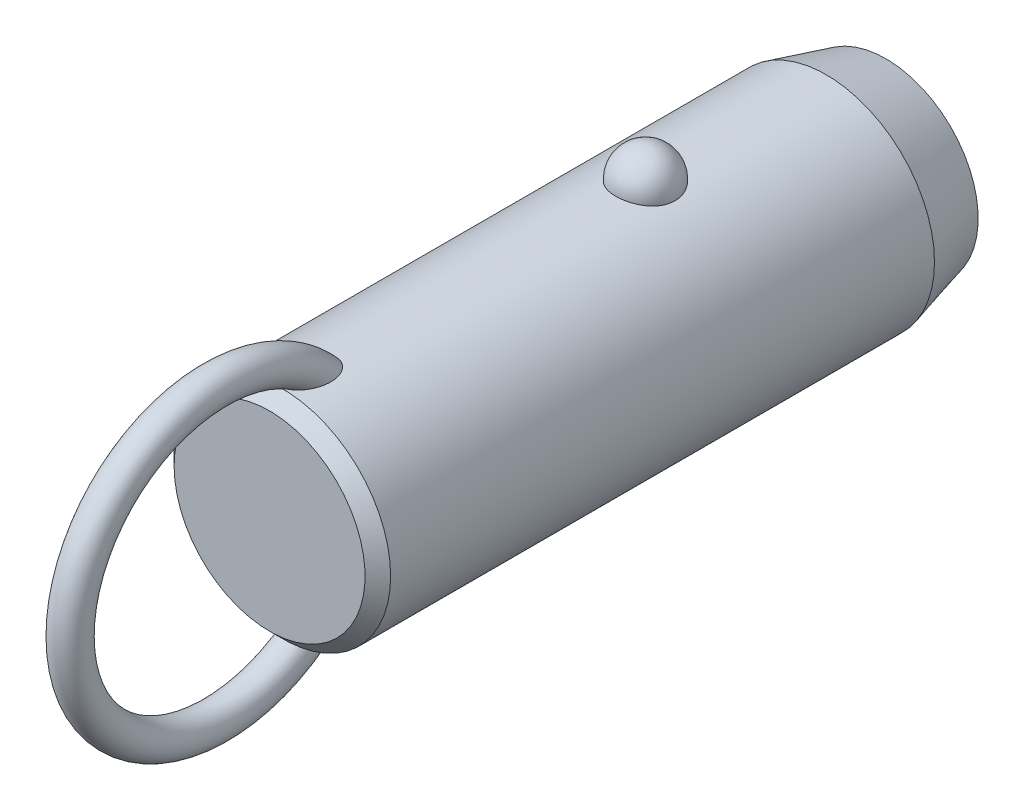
ISO-10303-21;
HEADER;
FILE_DESCRIPTION(('STEP AP214'),'2;1');
FILE_NAME('part.step','',(''),(''),'','','');
FILE_SCHEMA(('AUTOMOTIVE_DESIGN { 1 0 10303 214 1 1 1 1 }'));
ENDSEC;
DATA;
#1=APPLICATION_CONTEXT('core data for automotive mechanical design processes');
#2=APPLICATION_PROTOCOL_DEFINITION('international standard','automotive_design',2000,#1);
#3=PRODUCT_CONTEXT('',#1,'mechanical');
#4=PRODUCT('Part','Part','',(#3));
#5=PRODUCT_RELATED_PRODUCT_CATEGORY('part','',(#4));
#6=PRODUCT_DEFINITION_FORMATION('','',#4);
#7=PRODUCT_DEFINITION_CONTEXT('part definition',#1,'design');
#8=PRODUCT_DEFINITION('design','',#6,#7);
#9=PRODUCT_DEFINITION_SHAPE('','',#8);
#10=(LENGTH_UNIT() NAMED_UNIT(*) SI_UNIT(.MILLI.,.METRE.));
#11=(NAMED_UNIT(*) PLANE_ANGLE_UNIT() SI_UNIT($,.RADIAN.));
#12=(NAMED_UNIT(*) SI_UNIT($,.STERADIAN.) SOLID_ANGLE_UNIT());
#13=UNCERTAINTY_MEASURE_WITH_UNIT(LENGTH_MEASURE(1.E-05),#10,'distance_accuracy_value','');
#14=(GEOMETRIC_REPRESENTATION_CONTEXT(3) GLOBAL_UNCERTAINTY_ASSIGNED_CONTEXT((#13)) GLOBAL_UNIT_ASSIGNED_CONTEXT((#10,
#11,#12)) REPRESENTATION_CONTEXT('',''));
#15=CARTESIAN_POINT('',(0.,0.,0.));
#16=DIRECTION('',(0.,0.,1.));
#17=DIRECTION('',(1.,0.,0.));
#18=AXIS2_PLACEMENT_3D('',#15,#16,#17);
#19=CARTESIAN_POINT('',(0.,0.,27.9));
#20=DIRECTION('',(0.,0.,-1.));
#21=DIRECTION('',(-1.,0.,0.));
#22=AXIS2_PLACEMENT_3D('',#19,#20,#21);
#23=CYLINDRICAL_SURFACE('',#22,12.7);
#24=CARTESIAN_POINT('',(3.46661256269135,12.2177165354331,-3.5));
#25=CARTESIAN_POINT('',(3.4666090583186,12.2177194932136,-3.30432790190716));
#26=CARTESIAN_POINT('',(3.45063567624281,12.2222841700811,-3.10861112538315));
#27=CARTESIAN_POINT('',(3.38712451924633,12.2400345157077,-2.72271899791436));
#28=CARTESIAN_POINT('',(3.33957415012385,12.2532236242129,-2.53254588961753));
#29=CARTESIAN_POINT('',(3.2141234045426,12.286724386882,-2.16324948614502));
#30=CARTESIAN_POINT('',(3.13623639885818,12.3070329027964,-1.98412136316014));
#31=CARTESIAN_POINT('',(2.95205930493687,12.3525018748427,-1.64180592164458));
#32=CARTESIAN_POINT('',(2.84577003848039,12.3776621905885,-1.47861814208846));
#33=CARTESIAN_POINT('',(2.60688050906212,12.4301712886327,-1.17190583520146));
#34=CARTESIAN_POINT('',(2.47415697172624,12.4575299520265,-1.02847897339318));
#35=CARTESIAN_POINT('',(2.18615174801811,12.5112810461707,-0.766177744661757));
#36=CARTESIAN_POINT('',(2.03087002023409,12.5376734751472,-0.647303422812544));
#37=CARTESIAN_POINT('',(1.70237334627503,12.5864761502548,-0.437732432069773));
#38=CARTESIAN_POINT('',(1.52920948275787,12.6088972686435,-0.34695830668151));
#39=CARTESIAN_POINT('',(1.16944170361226,12.6473352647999,-0.195750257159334));
#40=CARTESIAN_POINT('',(0.982839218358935,12.663352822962,-0.135313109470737));
#41=CARTESIAN_POINT('',(0.604961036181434,12.6869706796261,-0.0473241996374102));
#42=CARTESIAN_POINT('',(0.413823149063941,12.6947125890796,-0.0192185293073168));
#43=CARTESIAN_POINT('',(0.0293827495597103,12.7014203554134,0.00517254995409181));
#44=CARTESIAN_POINT('',(-0.163919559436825,12.7003870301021,0.00146092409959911));
#45=CARTESIAN_POINT('',(-0.544374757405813,12.689735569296,-0.0373939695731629));
#46=CARTESIAN_POINT('',(-0.731575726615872,12.6802364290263,-0.0721015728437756));
#47=CARTESIAN_POINT('',(-1.09733277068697,12.6538333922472,-0.171364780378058));
#48=CARTESIAN_POINT('',(-1.27588869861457,12.6369293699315,-0.23592089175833));
#49=CARTESIAN_POINT('',(-1.6204698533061,12.5973946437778,-0.393548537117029));
#50=CARTESIAN_POINT('',(-1.78641865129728,12.5747321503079,-0.48677898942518));
#51=CARTESIAN_POINT('',(-2.10030671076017,12.5261316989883,-0.699110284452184));
#52=CARTESIAN_POINT('',(-2.24824419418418,12.5001934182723,-0.818213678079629));
#53=CARTESIAN_POINT('',(-2.52491489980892,12.4472906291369,-1.08157124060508));
#54=CARTESIAN_POINT('',(-2.65324222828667,12.4203160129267,-1.22624992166));
#55=CARTESIAN_POINT('',(-2.88410007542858,12.3687509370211,-1.53528325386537));
#56=CARTESIAN_POINT('',(-2.98662883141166,12.3441606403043,-1.69963924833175));
#57=CARTESIAN_POINT('',(-3.16432417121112,12.2998199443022,-2.04548497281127));
#58=CARTESIAN_POINT('',(-3.23917525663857,12.2801261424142,-2.22714424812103));
#59=CARTESIAN_POINT('',(-3.35800573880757,12.248167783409,-2.6009138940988));
#60=CARTESIAN_POINT('',(-3.4019860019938,12.2359030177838,-2.79302397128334));
#61=CARTESIAN_POINT('',(-3.45784812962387,12.2202347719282,-3.18140279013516));
#62=CARTESIAN_POINT('',(-3.46986123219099,12.2167950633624,-3.37765118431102));
#63=CARTESIAN_POINT('',(-3.46186273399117,12.2190638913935,-3.76943689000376));
#64=CARTESIAN_POINT('',(-3.44185196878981,12.2247721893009,-3.96497421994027));
#65=CARTESIAN_POINT('',(-3.37048652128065,12.2446381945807,-4.34881728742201));
#66=CARTESIAN_POINT('',(-3.31928253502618,12.2587552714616,-4.53715319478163));
#67=CARTESIAN_POINT('',(-3.18693461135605,12.2938237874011,-4.90231727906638));
#68=CARTESIAN_POINT('',(-3.1057895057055,12.3147754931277,-5.07914500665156));
#69=CARTESIAN_POINT('',(-2.91506431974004,12.3613125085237,-5.4173205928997));
#70=CARTESIAN_POINT('',(-2.80533587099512,12.3869217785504,-5.57858147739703));
#71=CARTESIAN_POINT('',(-2.560414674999,12.4398525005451,-5.88013283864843));
#72=CARTESIAN_POINT('',(-2.42522099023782,12.4671740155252,-6.02042254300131));
#73=CARTESIAN_POINT('',(-2.1323357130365,12.5205965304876,-6.27662798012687));
#74=CARTESIAN_POINT('',(-1.97456596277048,12.5466928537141,-6.39245542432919));
#75=CARTESIAN_POINT('',(-1.64115839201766,12.5946384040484,-6.59583547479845));
#76=CARTESIAN_POINT('',(-1.46552179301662,12.6164879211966,-6.68339001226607));
#77=CARTESIAN_POINT('',(-1.10356050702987,12.6532533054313,-6.82682153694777));
#78=CARTESIAN_POINT('',(-0.917391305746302,12.6682500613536,-6.88306988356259));
#79=CARTESIAN_POINT('',(-0.537836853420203,12.6900288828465,-6.96386887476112));
#80=CARTESIAN_POINT('',(-0.344452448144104,12.6968119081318,-6.9884232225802));
#81=CARTESIAN_POINT('',(0.0402577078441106,12.7013667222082,-7.00496469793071));
#82=CARTESIAN_POINT('',(0.231556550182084,12.6993008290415,-6.99753844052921));
#83=CARTESIAN_POINT('',(0.610105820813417,12.6867505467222,-6.95166366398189));
#84=CARTESIAN_POINT('',(0.797356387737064,12.6762664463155,-6.91321620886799));
#85=CARTESIAN_POINT('',(1.16186657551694,12.6480587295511,-6.80658431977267));
#86=CARTESIAN_POINT('',(1.33915951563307,12.6303611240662,-6.73850666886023));
#87=CARTESIAN_POINT('',(1.67968518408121,12.5896027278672,-6.57450875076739));
#88=CARTESIAN_POINT('',(1.84291705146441,12.5665416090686,-6.47858678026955));
#89=CARTESIAN_POINT('',(2.15340192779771,12.5171072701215,-6.25982455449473));
#90=CARTESIAN_POINT('',(2.30037831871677,12.4906895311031,-6.13660186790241));
#91=CARTESIAN_POINT('',(2.5717412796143,12.4376567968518,-5.86739587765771));
#92=CARTESIAN_POINT('',(2.69612388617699,12.4110417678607,-5.72140858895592));
#93=CARTESIAN_POINT('',(2.92107785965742,12.360051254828,-5.40794137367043));
#94=CARTESIAN_POINT('',(3.02121329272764,12.3357209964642,-5.24014110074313));
#95=CARTESIAN_POINT('',(3.19236291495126,12.2925446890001,-4.8896986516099));
#96=CARTESIAN_POINT('',(3.26338839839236,12.2736965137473,-4.70706226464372));
#97=CARTESIAN_POINT('',(3.36788038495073,12.245404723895,-4.35469510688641));
#98=CARTESIAN_POINT('',(3.40484026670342,12.2351018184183,-4.18605935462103));
#99=CARTESIAN_POINT('',(3.45420764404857,12.2212564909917,-3.84496058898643));
#100=CARTESIAN_POINT('',(3.46661565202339,12.2177139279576,-3.67249765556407));
#101=CARTESIAN_POINT('',(3.46661256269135,12.2177165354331,-3.5));
#102=B_SPLINE_CURVE_WITH_KNOTS('',3,(#24,#25,#26,#27,#28,#29,#30,#31,#32,#33,#34,#35,#36,#37,
#38,#39,#40,#41,#42,#43,#44,#45,#46,#47,#48,#49,#50,#51,#52,#53,#54,#55,#56,#57,#58,#59,#60,#61,
#62,#63,#64,#65,#66,#67,#68,#69,#70,#71,#72,#73,#74,#75,#76,#77,#78,#79,#80,#81,#82,#83,#84,#85,
#86,#87,#88,#89,#90,#91,#92,#93,#94,#95,#96,#97,#98,#99,#100,#101),.UNSPECIFIED.,.T.,.F.,(4,2,2,
2,2,2,2,2,2,2,2,2,2,2,2,2,2,2,2,2,2,2,2,2,2,2,2,2,2,2,2,2,2,2,2,2,2,2,4),(0.,0.586396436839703,
1.17302689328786,1.7593990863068,2.34575431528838,2.93491084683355,3.52406845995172,
4.1115873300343,4.69904375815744,5.2762784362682,5.85345931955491,6.42265312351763,
6.99185659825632,7.56427334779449,8.136746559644,8.71981013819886,9.3029135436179,
9.89247258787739,10.4820150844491,11.0691335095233,11.6562366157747,12.2405256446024,
12.8248374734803,13.412244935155,13.9996740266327,14.5891883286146,15.1786623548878,
15.7609861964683,16.3432419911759,16.914863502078,17.4864654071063,18.056024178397,
18.6256177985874,19.2037609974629,19.7820055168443,20.3699810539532,20.9577282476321,
21.4746855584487,21.9916320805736),.UNSPECIFIED.);
#103=CARTESIAN_POINT('',(3.46661256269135,12.2177165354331,-3.5));
#104=VERTEX_POINT('',#103);
#105=EDGE_CURVE('E41',#104,#104,#102,.T.);
#106=ORIENTED_EDGE('',*,*,#105,.T.);
#107=EDGE_LOOP('',(#106));
#108=FACE_BOUND('',#107,.T.);
#109=CARTESIAN_POINT('',(0.,0.,39.1));
#110=DIRECTION('',(0.,0.,1.));
#111=DIRECTION('',(1.,0.,0.));
#112=AXIS2_PLACEMENT_3D('',#109,#110,#111);
#113=CIRCLE('',#112,12.7);
#114=CARTESIAN_POINT('',(-12.7,0.,39.1));
#115=VERTEX_POINT('',#114);
#116=EDGE_CURVE('E10',#115,#115,#113,.F.);
#117=ORIENTED_EDGE('',*,*,#116,.T.);
#118=EDGE_LOOP('',(#117));
#119=FACE_BOUND('',#118,.T.);
#120=CARTESIAN_POINT('',(-0.548122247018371,-12.6881662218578,32.8432187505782));
#121=CARTESIAN_POINT('',(-0.648865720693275,-12.6838128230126,32.877926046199));
#122=CARTESIAN_POINT('',(-0.746398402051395,-12.6783867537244,32.9220428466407));
#123=CARTESIAN_POINT('',(-0.932125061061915,-12.666091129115,33.0267647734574));
#124=CARTESIAN_POINT('',(-1.02030388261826,-12.6592192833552,33.087396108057));
#125=CARTESIAN_POINT('',(-1.18487740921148,-12.6448747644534,33.221847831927));
#126=CARTESIAN_POINT('',(-1.26134296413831,-12.637406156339,33.2955825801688));
#127=CARTESIAN_POINT('',(-1.4023120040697,-12.6225412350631,33.4536045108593));
#128=CARTESIAN_POINT('',(-1.46681470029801,-12.6151449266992,33.5378923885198));
#129=CARTESIAN_POINT('',(-1.60714786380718,-12.5981718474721,33.7496577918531));
#130=CARTESIAN_POINT('',(-1.67725126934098,-12.588900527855,33.8809624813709));
#131=CARTESIAN_POINT('',(-1.79536591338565,-12.5725964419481,34.1532471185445));
#132=CARTESIAN_POINT('',(-1.84333535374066,-12.5655679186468,34.2942447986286));
#133=CARTESIAN_POINT('',(-1.93422576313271,-12.5519624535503,34.6376455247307));
#134=CARTESIAN_POINT('',(-1.96788773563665,-12.5466298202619,34.8425578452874));
#135=CARTESIAN_POINT('',(-1.9941399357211,-12.542463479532,35.1517600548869));
#136=CARTESIAN_POINT('',(-1.99883864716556,-12.5417153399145,35.2552987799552));
#137=CARTESIAN_POINT('',(-2.00078003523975,-12.5414074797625,35.4624512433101));
#138=CARTESIAN_POINT('',(-1.99802449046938,-12.5418474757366,35.5660649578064));
#139=CARTESIAN_POINT('',(-1.98336733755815,-12.5441750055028,35.8103207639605));
#140=CARTESIAN_POINT('',(-1.96851430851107,-12.5465291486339,35.950780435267));
#141=CARTESIAN_POINT('',(-1.92707089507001,-12.5529612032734,36.229960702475));
#142=CARTESIAN_POINT('',(-1.900474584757,-12.5570399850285,36.3686803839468));
#143=CARTESIAN_POINT('',(-1.83619120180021,-12.5666008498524,36.6434113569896));
#144=CARTESIAN_POINT('',(-1.79850828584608,-12.57208240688,36.7794236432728));
#145=CARTESIAN_POINT('',(-1.71223796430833,-12.5841228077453,37.0478421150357));
#146=CARTESIAN_POINT('',(-1.66365679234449,-12.5906810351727,37.1802503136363));
#147=CARTESIAN_POINT('',(-1.57804503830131,-12.6016176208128,37.3854887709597));
#148=CARTESIAN_POINT('',(-1.54477252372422,-12.6057501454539,37.4599149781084));
#149=CARTESIAN_POINT('',(-1.47424480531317,-12.6141930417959,37.6068393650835));
#150=CARTESIAN_POINT('',(-1.43699041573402,-12.6185033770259,37.6793379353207));
#151=CARTESIAN_POINT('',(-1.35825795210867,-12.6272207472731,37.8218926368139));
#152=CARTESIAN_POINT('',(-1.31678520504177,-12.6316276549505,37.8919517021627));
#153=CARTESIAN_POINT('',(-1.22917793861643,-12.6404532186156,38.0290705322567));
#154=CARTESIAN_POINT('',(-1.18304514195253,-12.6448718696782,38.0961313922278));
#155=CARTESIAN_POINT('',(-1.0724641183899,-12.6547893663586,38.2438741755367));
#156=CARTESIAN_POINT('',(-1.00642239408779,-12.6602600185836,38.3233844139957));
#157=CARTESIAN_POINT('',(-0.864441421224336,-12.6707460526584,38.4731698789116));
#158=CARTESIAN_POINT('',(-0.78851691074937,-12.6757620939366,38.5434585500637));
#159=CARTESIAN_POINT('',(-0.652215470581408,-12.6833591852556,38.6486801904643));
#160=CARTESIAN_POINT('',(-0.594982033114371,-12.6861973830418,38.6876241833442));
#161=CARTESIAN_POINT('',(-0.475269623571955,-12.6912445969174,38.7564899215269));
#162=CARTESIAN_POINT('',(-0.412800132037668,-12.6934547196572,38.7864275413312));
#163=CARTESIAN_POINT('',(-0.295749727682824,-12.6966636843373,38.8297565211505));
#164=CARTESIAN_POINT('',(-0.241949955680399,-12.6978134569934,38.8452188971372));
#165=CARTESIAN_POINT('',(-0.13250810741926,-12.6994261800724,38.8668845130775));
#166=CARTESIAN_POINT('',(-0.0768679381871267,-12.6998898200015,38.8730970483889));
#167=CARTESIAN_POINT('',(0.0347696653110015,-12.7000752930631,38.8755838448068));
#168=CARTESIAN_POINT('',(0.0907676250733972,-12.6997954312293,38.8718353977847));
#169=CARTESIAN_POINT('',(0.201283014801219,-12.6985255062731,38.8547883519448));
#170=CARTESIAN_POINT('',(0.255799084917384,-12.6975348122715,38.8414812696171));
#171=CARTESIAN_POINT('',(0.376042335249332,-12.6946091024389,38.8020379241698));
#172=CARTESIAN_POINT('',(0.440950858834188,-12.6924943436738,38.7734492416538));
#173=CARTESIAN_POINT('',(0.565350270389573,-12.6875639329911,38.7063234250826));
#174=CARTESIAN_POINT('',(0.624828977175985,-12.6847467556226,38.6677646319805));
#175=CARTESIAN_POINT('',(0.774116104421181,-12.6767252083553,38.556949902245));
#176=CARTESIAN_POINT('',(0.859449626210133,-12.6711344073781,38.4787605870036));
#177=CARTESIAN_POINT('',(1.01789440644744,-12.6593922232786,38.310943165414));
#178=CARTESIAN_POINT('',(1.09096902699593,-12.653239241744,38.221282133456));
#179=CARTESIAN_POINT('',(1.22268793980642,-12.6411674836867,38.0402658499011));
#180=CARTESIAN_POINT('',(1.28193986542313,-12.6352572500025,37.949345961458));
#181=CARTESIAN_POINT('',(1.39259777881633,-12.6235401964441,37.7627929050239));
#182=CARTESIAN_POINT('',(1.44399707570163,-12.6177334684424,37.6671558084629));
#183=CARTESIAN_POINT('',(1.53972870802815,-12.6064093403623,37.4722738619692));
#184=CARTESIAN_POINT('',(1.58405262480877,-12.6008922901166,37.3730248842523));
#185=CARTESIAN_POINT('',(1.66600705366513,-12.5903187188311,37.1717727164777));
#186=CARTESIAN_POINT('',(1.7036365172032,-12.5852622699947,37.0697690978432));
#187=CARTESIAN_POINT('',(1.77545379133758,-12.5753406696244,36.8543580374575));
#188=CARTESIAN_POINT('',(1.80903453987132,-12.5705328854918,36.740745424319));
#189=CARTESIAN_POINT('',(1.86844163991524,-12.5618400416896,36.5114575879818));
#190=CARTESIAN_POINT('',(1.89426665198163,-12.5579551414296,36.3957820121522));
#191=CARTESIAN_POINT('',(1.9378546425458,-12.5513030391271,36.1630072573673));
#192=CARTESIAN_POINT('',(1.9556264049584,-12.5485346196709,36.0459097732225));
#193=CARTESIAN_POINT('',(1.98264463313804,-12.5442934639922,35.8107473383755));
#194=CARTESIAN_POINT('',(1.99189298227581,-12.5428204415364,35.6926826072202));
#195=CARTESIAN_POINT('',(2.00416068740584,-12.540871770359,35.3806225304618));
#196=CARTESIAN_POINT('',(1.99944433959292,-12.541631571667,35.1862290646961));
#197=CARTESIAN_POINT('',(1.96113755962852,-12.5476846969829,34.8003095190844));
#198=CARTESIAN_POINT('',(1.92758341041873,-12.5529723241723,34.6087801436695));
#199=CARTESIAN_POINT('',(1.8393434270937,-12.5661532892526,34.2822728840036));
#200=CARTESIAN_POINT('',(1.79215440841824,-12.5730485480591,34.1452499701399));
#201=CARTESIAN_POINT('',(1.67676242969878,-12.588958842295,33.8804459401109));
#202=CARTESIAN_POINT('',(1.60859050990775,-12.597970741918,33.7526515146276));
#203=CARTESIAN_POINT('',(1.46583832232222,-12.6152829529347,33.5358006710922));
#204=CARTESIAN_POINT('',(1.39525727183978,-12.6233659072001,33.4441050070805));
#205=CARTESIAN_POINT('',(1.23992594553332,-12.6395676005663,33.2734854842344));
#206=CARTESIAN_POINT('',(1.15517932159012,-12.6476863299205,33.1945583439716));
#207=CARTESIAN_POINT('',(0.971995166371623,-12.6630846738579,33.0526438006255));
#208=CARTESIAN_POINT('',(0.873456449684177,-12.6703572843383,32.9897849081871));
#209=CARTESIAN_POINT('',(0.665847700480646,-12.6829569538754,32.8844870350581));
#210=CARTESIAN_POINT('',(0.556784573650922,-12.688285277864,32.8420347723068));
#211=CARTESIAN_POINT('',(0.347338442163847,-12.6956226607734,32.7844434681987));
#212=CARTESIAN_POINT('',(0.247759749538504,-12.6979816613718,32.7663996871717));
#213=CARTESIAN_POINT('',(0.0470218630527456,-12.7003077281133,32.748600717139));
#214=CARTESIAN_POINT('',(-0.0541350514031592,-12.7002779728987,32.7488212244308));
#215=CARTESIAN_POINT('',(-0.221414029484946,-12.6982482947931,32.7643639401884));
#216=CARTESIAN_POINT('',(-0.288055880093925,-12.6969033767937,32.7746662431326));
#217=CARTESIAN_POINT('',(-0.41959929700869,-12.6932369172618,32.8031348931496));
#218=CARTESIAN_POINT('',(-0.484501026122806,-12.6909154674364,32.8213005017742));
#219=CARTESIAN_POINT('',(-0.548122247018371,-12.6881662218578,32.8432187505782));
#220=B_SPLINE_CURVE_WITH_KNOTS('',3,(#120,#121,#122,#123,#124,#125,#126,#127,#128,#129,#130,
#131,#132,#133,#134,#135,#136,#137,#138,#139,#140,#141,#142,#143,#144,#145,#146,#147,#148,#149,
#150,#151,#152,#153,#154,#155,#156,#157,#158,#159,#160,#161,#162,#163,#164,#165,#166,#167,#168,
#169,#170,#171,#172,#173,#174,#175,#176,#177,#178,#179,#180,#181,#182,#183,#184,#185,#186,#187,
#188,#189,#190,#191,#192,#193,#194,#195,#196,#197,#198,#199,#200,#201,#202,#203,#204,#205,#206,
#207,#208,#209,#210,#211,#212,#213,#214,#215,#216,#217,#218,#219),.UNSPECIFIED.,.T.,.F.,(4,2,2,
2,2,2,2,2,2,2,2,2,2,2,2,2,2,2,2,2,2,2,2,2,2,2,2,2,2,2,2,2,2,2,2,2,2,2,2,2,2,2,2,2,2,2,2,2,2,4),
(0.,0.31964225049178,0.639794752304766,0.957927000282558,1.27608021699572,1.72100165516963,
2.16675988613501,2.78630021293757,3.09705782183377,3.40774128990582,3.83096358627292,
4.25439969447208,4.67767724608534,5.1007133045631,5.34550297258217,5.59024267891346,
5.83467707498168,6.07902143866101,6.38891080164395,6.69834321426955,6.90560910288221,
7.11250749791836,7.27977315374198,7.44687060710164,7.61434932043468,7.78197685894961,
7.99365544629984,8.20579780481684,8.55147335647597,8.89816429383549,9.22375138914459,
9.54961437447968,9.8758622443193,10.2021611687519,10.557587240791,10.9130746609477,
11.2681734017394,11.6231936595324,12.2046601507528,12.7853961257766,13.219164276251,
13.6522938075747,13.9989174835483,14.3454519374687,14.6946768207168,15.0436740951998,
15.3457513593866,15.6474266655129,15.8493051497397,16.0511646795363),.UNSPECIFIED.);
#221=CARTESIAN_POINT('',(-0.548122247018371,-12.6881662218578,32.8432187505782));
#222=VERTEX_POINT('',#221);
#223=EDGE_CURVE('E60',#222,#222,#220,.T.);
#224=ORIENTED_EDGE('',*,*,#223,.T.);
#225=EDGE_LOOP('',(#224));
#226=FACE_BOUND('',#225,.T.);
#227=CARTESIAN_POINT('',(-0.548122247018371,12.6881662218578,32.8432187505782));
#228=CARTESIAN_POINT('',(-0.459436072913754,12.6919968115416,32.812673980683));
#229=CARTESIAN_POINT('',(-0.368189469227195,12.6949996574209,32.7893913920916));
#230=CARTESIAN_POINT('',(-0.183024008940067,12.6990186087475,32.7584062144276));
#231=CARTESIAN_POINT('',(-0.0891049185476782,12.7000345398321,32.7507049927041));
#232=CARTESIAN_POINT('',(0.0987147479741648,12.6999636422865,32.7512455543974));
#233=CARTESIAN_POINT('',(0.1926153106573,12.6988761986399,32.759492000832));
#234=CARTESIAN_POINT('',(0.377658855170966,12.6947211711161,32.7915515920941));
#235=CARTESIAN_POINT('',(0.468801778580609,12.6916535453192,32.8153650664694));
#236=CARTESIAN_POINT('',(0.64580934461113,12.6838788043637,32.8774565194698));
#237=CARTESIAN_POINT('',(0.731679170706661,12.6791733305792,32.915720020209));
#238=CARTESIAN_POINT('',(0.896315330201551,12.6686004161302,33.005120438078));
#239=CARTESIAN_POINT('',(0.97508059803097,12.6627328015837,33.0562592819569));
#240=CARTESIAN_POINT('',(1.12963655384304,12.6499161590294,33.1736782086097));
#241=CARTESIAN_POINT('',(1.20478673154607,12.6429194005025,33.2407929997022));
#242=CARTESIAN_POINT('',(1.34448241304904,12.6288282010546,33.3852250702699));
#243=CARTESIAN_POINT('',(1.40902173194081,12.621733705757,33.4625482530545));
#244=CARTESIAN_POINT('',(1.55208211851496,12.6050877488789,33.6592475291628));
#245=CARTESIAN_POINT('',(1.62510490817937,12.5957546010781,33.7826540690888));
#246=CARTESIAN_POINT('',(1.7501904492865,12.5789823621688,34.0397690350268));
#247=CARTESIAN_POINT('',(1.80221377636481,12.5715468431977,34.1734962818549));
#248=CARTESIAN_POINT('',(1.90309965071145,12.5567434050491,34.4983516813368));
#249=CARTESIAN_POINT('',(1.94342317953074,12.5504515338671,34.6921611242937));
#250=CARTESIAN_POINT('',(1.99332997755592,12.5426147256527,35.0837881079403));
#251=CARTESIAN_POINT('',(2.00285305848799,12.5410790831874,35.281612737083));
#252=CARTESIAN_POINT('',(1.99678999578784,12.5420407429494,35.6166427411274));
#253=CARTESIAN_POINT('',(1.98794117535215,12.5434564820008,35.7540428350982));
#254=CARTESIAN_POINT('',(1.95865119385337,12.5480641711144,36.0276394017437));
#255=CARTESIAN_POINT('',(1.93820436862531,12.5512569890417,36.1638352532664));
#256=CARTESIAN_POINT('',(1.88647896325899,12.5591352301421,36.4342493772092));
#257=CARTESIAN_POINT('',(1.85518800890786,12.5638223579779,36.5684652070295));
#258=CARTESIAN_POINT('',(1.78217886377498,12.5743868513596,36.8339362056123));
#259=CARTESIAN_POINT('',(1.74046509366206,12.5802637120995,36.9651926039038));
#260=CARTESIAN_POINT('',(1.66024095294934,12.5910571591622,37.1860855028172));
#261=CARTESIAN_POINT('',(1.62434772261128,12.5957535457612,37.2766904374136));
#262=CARTESIAN_POINT('',(1.54709009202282,12.6054762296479,37.4555125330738));
#263=CARTESIAN_POINT('',(1.50572681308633,12.6105024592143,37.5437301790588));
#264=CARTESIAN_POINT('',(1.41728020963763,12.620748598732,37.7169321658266));
#265=CARTESIAN_POINT('',(1.37021377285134,12.625967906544,37.8019251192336));
#266=CARTESIAN_POINT('',(1.26969620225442,12.6364721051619,37.9680072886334));
#267=CARTESIAN_POINT('',(1.21624929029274,12.6417569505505,38.0490990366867));
#268=CARTESIAN_POINT('',(1.10304413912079,12.6521331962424,38.2047027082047));
#269=CARTESIAN_POINT('',(1.04340936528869,12.657226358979,38.2793033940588));
#270=CARTESIAN_POINT('',(0.915919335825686,12.6670906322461,38.421324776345));
#271=CARTESIAN_POINT('',(0.84806456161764,12.6718617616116,38.4887458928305));
#272=CARTESIAN_POINT('',(0.717035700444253,12.67987711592,38.6006247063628));
#273=CARTESIAN_POINT('',(0.655526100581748,12.6832377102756,38.6469970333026));
#274=CARTESIAN_POINT('',(0.525985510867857,12.6892676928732,38.7296195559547));
#275=CARTESIAN_POINT('',(0.457969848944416,12.6919386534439,38.7658927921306));
#276=CARTESIAN_POINT('',(0.334859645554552,12.695691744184,38.8166572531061));
#277=CARTESIAN_POINT('',(0.28111658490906,12.6970073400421,38.8343733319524));
#278=CARTESIAN_POINT('',(0.171425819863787,12.6989609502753,38.8606429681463));
#279=CARTESIAN_POINT('',(0.115480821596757,12.699599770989,38.8692074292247));
#280=CARTESIAN_POINT('',(0.00272618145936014,12.7001251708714,38.8762531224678));
#281=CARTESIAN_POINT('',(-0.0540859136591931,12.7000089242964,38.874696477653));
#282=CARTESIAN_POINT('',(-0.166544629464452,12.6990328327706,38.8616005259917));
#283=CARTESIAN_POINT('',(-0.222190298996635,12.6981724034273,38.8500533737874));
#284=CARTESIAN_POINT('',(-0.342018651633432,12.695562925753,38.8149128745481));
#285=CARTESIAN_POINT('',(-0.405606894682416,12.6936676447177,38.7893322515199));
#286=CARTESIAN_POINT('',(-0.527815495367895,12.6891754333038,38.7283111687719));
#287=CARTESIAN_POINT('',(-0.586425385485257,12.6865770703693,38.6928505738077));
#288=CARTESIAN_POINT('',(-0.731842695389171,12.6792129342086,38.5914960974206));
#289=CARTESIAN_POINT('',(-0.814709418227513,12.6740767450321,38.5200395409));
#290=CARTESIAN_POINT('',(-0.969101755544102,12.6632083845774,38.3658900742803));
#291=CARTESIAN_POINT('',(-1.04059564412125,12.6574746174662,38.2831668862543));
#292=CARTESIAN_POINT('',(-1.16981116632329,12.6461638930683,38.1158096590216));
#293=CARTESIAN_POINT('',(-1.22811369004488,12.6405994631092,38.0316166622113));
#294=CARTESIAN_POINT('',(-1.33743405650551,12.6295007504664,37.8585791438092));
#295=CARTESIAN_POINT('',(-1.38844577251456,12.6239664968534,37.7697307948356));
#296=CARTESIAN_POINT('',(-1.4840070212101,12.6130898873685,37.588389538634));
#297=CARTESIAN_POINT('',(-1.52854232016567,12.6077479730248,37.4958891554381));
#298=CARTESIAN_POINT('',(-1.6115011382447,12.5974127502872,37.3081607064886));
#299=CARTESIAN_POINT('',(-1.64992317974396,12.5924195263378,37.2129319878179));
#300=CARTESIAN_POINT('',(-1.73468589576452,12.581070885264,36.9828936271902));
#301=CARTESIAN_POINT('',(-1.77831261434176,12.5749388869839,36.8470661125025));
#302=CARTESIAN_POINT('',(-1.85439734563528,12.5639437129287,36.5722128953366));
#303=CARTESIAN_POINT('',(-1.88684994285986,12.5590811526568,36.4331856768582));
#304=CARTESIAN_POINT('',(-1.94008483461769,12.550968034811,36.1530923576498));
#305=CARTESIAN_POINT('',(-1.96088706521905,12.5477147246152,36.0120301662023));
#306=CARTESIAN_POINT('',(-1.99000539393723,12.5431291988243,35.7286689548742));
#307=CARTESIAN_POINT('',(-1.99832911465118,12.5417958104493,35.5863707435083));
#308=CARTESIAN_POINT('',(-2.00166624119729,12.5412674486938,35.2576271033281));
#309=CARTESIAN_POINT('',(-1.99178843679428,12.5428579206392,35.071088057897));
#310=CARTESIAN_POINT('',(-1.9445518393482,12.5502731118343,34.7016240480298));
#311=CARTESIAN_POINT('',(-1.90724032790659,12.5560905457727,34.5186934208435));
#312=CARTESIAN_POINT('',(-1.81330718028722,12.5699462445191,34.2048488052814));
#313=CARTESIAN_POINT('',(-1.76338820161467,12.5771273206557,34.0719105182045));
#314=CARTESIAN_POINT('',(-1.64305018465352,12.593414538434,33.8156813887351));
#315=CARTESIAN_POINT('',(-1.57265346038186,12.6025185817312,33.692380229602));
#316=CARTESIAN_POINT('',(-1.42634956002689,12.6198178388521,33.4835648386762));
#317=CARTESIAN_POINT('',(-1.35423772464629,12.6278405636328,33.3953846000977));
#318=CARTESIAN_POINT('',(-1.19645664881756,12.6437632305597,33.232107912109));
#319=CARTESIAN_POINT('',(-1.11080536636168,12.6516633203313,33.1569944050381));
#320=CARTESIAN_POINT('',(-0.947219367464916,12.6648319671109,33.0378114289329));
#321=CARTESIAN_POINT('',(-0.871624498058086,12.670300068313,32.9905414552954));
#322=CARTESIAN_POINT('',(-0.714161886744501,12.6801492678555,32.9077413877));
#323=CARTESIAN_POINT('',(-0.632295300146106,12.684530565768,32.8722091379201));
#324=CARTESIAN_POINT('',(-0.548122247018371,12.6881662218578,32.8432187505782));
#325=B_SPLINE_CURVE_WITH_KNOTS('',3,(#227,#228,#229,#230,#231,#232,#233,#234,#235,#236,#237,
#238,#239,#240,#241,#242,#243,#244,#245,#246,#247,#248,#249,#250,#251,#252,#253,#254,#255,#256,
#257,#258,#259,#260,#261,#262,#263,#264,#265,#266,#267,#268,#269,#270,#271,#272,#273,#274,#275,
#276,#277,#278,#279,#280,#281,#282,#283,#284,#285,#286,#287,#288,#289,#290,#291,#292,#293,#294,
#295,#296,#297,#298,#299,#300,#301,#302,#303,#304,#305,#306,#307,#308,#309,#310,#311,#312,#313,
#314,#315,#316,#317,#318,#319,#320,#321,#322,#323,#324),.UNSPECIFIED.,.T.,.F.,(4,2,2,2,2,2,2,2,
2,2,2,2,2,2,2,2,2,2,2,2,2,2,2,2,2,2,2,2,2,2,2,2,2,2,2,2,2,2,2,2,2,2,2,2,2,2,2,2,4),(0.,
0.281328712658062,0.562682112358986,0.844117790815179,1.12555942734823,1.40671982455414,
1.68792232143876,1.98972294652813,2.2916988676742,2.72039860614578,3.1498994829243,
3.74084916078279,4.33295293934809,4.7455410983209,5.15833092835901,5.57159335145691,
5.98468079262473,6.27722775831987,6.56971484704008,6.86135609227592,7.15280542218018,
7.4392740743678,7.72572595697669,7.95635862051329,8.18646071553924,8.35559393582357,
8.52452541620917,8.69408946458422,8.86378678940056,9.06834348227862,9.27332014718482,
9.60010414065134,9.92778432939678,10.2350252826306,10.5425229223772,10.8506864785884,
11.1589244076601,11.5867893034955,12.0148612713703,12.4421984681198,12.8692745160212,
13.4279365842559,13.9856380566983,14.4107062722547,14.8353130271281,15.1765567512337,
15.5173516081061,15.7844129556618,16.051425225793),.UNSPECIFIED.);
#326=CARTESIAN_POINT('',(-0.548122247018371,12.6881662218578,32.8432187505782));
#327=VERTEX_POINT('',#326);
#328=EDGE_CURVE('E67',#327,#327,#325,.T.);
#329=ORIENTED_EDGE('',*,*,#328,.T.);
#330=EDGE_LOOP('',(#329));
#331=FACE_BOUND('',#330,.T.);
#332=CARTESIAN_POINT('',(0.,0.,-24.6999999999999));
#333=DIRECTION('',(0.,0.,-1.));
#334=DIRECTION('',(-1.,0.,0.));
#335=AXIS2_PLACEMENT_3D('',#332,#333,#334);
#336=CIRCLE('',#335,12.7);
#337=CARTESIAN_POINT('',(-12.7,0.,-24.6999999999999));
#338=VERTEX_POINT('',#337);
#339=EDGE_CURVE('E57',#338,#338,#336,.F.);
#340=ORIENTED_EDGE('',*,*,#339,.T.);
#341=EDGE_LOOP('',(#340));
#342=FACE_BOUND('',#341,.T.);
#343=ADVANCED_FACE('F37',(#108,#119,#226,#331,#342),#23,.T.);
#344=CARTESIAN_POINT('',(0.,0.,-31.7));
#345=DIRECTION('',(0.,0.,-1.));
#346=DIRECTION('',(-1.,0.,0.));
#347=AXIS2_PLACEMENT_3D('',#344,#345,#346);
#348=PLANE('',#347);
#349=CARTESIAN_POINT('',(0.,0.,-31.7));
#350=DIRECTION('',(0.,0.,-1.));
#351=DIRECTION('',(-1.,0.,0.));
#352=AXIS2_PLACEMENT_3D('',#349,#350,#351);
#353=CIRCLE('',#352,10.8243556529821);
#354=CARTESIAN_POINT('',(-10.8243556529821,0.,-31.7));
#355=VERTEX_POINT('',#354);
#356=EDGE_CURVE('E66',#355,#355,#353,.T.);
#357=ORIENTED_EDGE('',*,*,#356,.T.);
#358=EDGE_LOOP('',(#357));
#359=FACE_BOUND('',#358,.T.);
#360=ADVANCED_FACE('F85',(#359),#348,.T.);
#361=CARTESIAN_POINT('',(0.,0.,-31.7));
#362=DIRECTION('',(0.,0.,1.));
#363=DIRECTION('',(1.,0.,0.));
#364=AXIS2_PLACEMENT_3D('',#361,#362,#363);
#365=CONICAL_SURFACE('',#364,10.8243556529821,0.261799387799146);
#366=ORIENTED_EDGE('',*,*,#339,.F.);
#367=EDGE_LOOP('',(#366));
#368=FACE_BOUND('',#367,.T.);
#369=ORIENTED_EDGE('',*,*,#356,.F.);
#370=EDGE_LOOP('',(#369));
#371=FACE_BOUND('',#370,.T.);
#372=ADVANCED_FACE('F83',(#368,#371),#365,.T.);
#373=CARTESIAN_POINT('',(0.,0.,40.6));
#374=DIRECTION('',(0.,0.,1.));
#375=DIRECTION('',(1.,0.,0.));
#376=AXIS2_PLACEMENT_3D('',#373,#374,#375);
#377=PLANE('',#376);
#378=CARTESIAN_POINT('',(0.,0.,40.6));
#379=DIRECTION('',(0.,0.,1.));
#380=DIRECTION('',(1.,0.,0.));
#381=AXIS2_PLACEMENT_3D('',#378,#379,#380);
#382=CIRCLE('',#381,11.2);
#383=CARTESIAN_POINT('',(-11.2,0.,40.6));
#384=VERTEX_POINT('',#383);
#385=EDGE_CURVE('E50',#384,#384,#382,.T.);
#386=ORIENTED_EDGE('',*,*,#385,.T.);
#387=EDGE_LOOP('',(#386));
#388=FACE_BOUND('',#387,.T.);
#389=ADVANCED_FACE('F77',(#388),#377,.T.);
#390=CARTESIAN_POINT('',(0.,0.,46.95));
#391=DIRECTION('',(1.,0.,0.));
#392=DIRECTION('',(0.,0.,-1.));
#393=AXIS2_PLACEMENT_3D('',#390,#391,#392);
#394=TOROIDAL_SURFACE('',#393,17.05,2.);
#395=ORIENTED_EDGE('',*,*,#328,.F.);
#396=EDGE_LOOP('',(#395));
#397=FACE_BOUND('',#396,.T.);
#398=ORIENTED_EDGE('',*,*,#223,.F.);
#399=EDGE_LOOP('',(#398));
#400=FACE_BOUND('',#399,.T.);
#401=ADVANCED_FACE('F73',(#397,#400),#394,.T.);
#402=CARTESIAN_POINT('',(0.,0.,40.6));
#403=DIRECTION('',(0.,0.,-1.));
#404=DIRECTION('',(-1.,0.,0.));
#405=AXIS2_PLACEMENT_3D('',#402,#403,#404);
#406=CONICAL_SURFACE('',#405,11.2,0.785398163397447);
#407=CARTESIAN_POINT('',(-12.7,0.,39.1));
#408=CARTESIAN_POINT('',(-12.684375,0.,39.115625));
#409=CARTESIAN_POINT('',(-12.66875,0.,39.13125));
#410=CARTESIAN_POINT('',(-12.6375,0.,39.1625));
#411=CARTESIAN_POINT('',(-12.621875,0.,39.178125));
#412=CARTESIAN_POINT('',(-12.590625,0.,39.209375));
#413=CARTESIAN_POINT('',(-12.575,0.,39.225));
#414=CARTESIAN_POINT('',(-12.54375,0.,39.25625));
#415=CARTESIAN_POINT('',(-12.528125,0.,39.271875));
#416=CARTESIAN_POINT('',(-12.496875,0.,39.303125));
#417=CARTESIAN_POINT('',(-12.48125,0.,39.31875));
#418=CARTESIAN_POINT('',(-12.45,0.,39.35));
#419=CARTESIAN_POINT('',(-12.434375,0.,39.365625));
#420=CARTESIAN_POINT('',(-12.403125,0.,39.396875));
#421=CARTESIAN_POINT('',(-12.3875,0.,39.4125));
#422=CARTESIAN_POINT('',(-12.35625,0.,39.44375));
#423=CARTESIAN_POINT('',(-12.340625,0.,39.459375));
#424=CARTESIAN_POINT('',(-12.309375,0.,39.490625));
#425=CARTESIAN_POINT('',(-12.29375,0.,39.50625));
#426=CARTESIAN_POINT('',(-12.2625,0.,39.5375));
#427=CARTESIAN_POINT('',(-12.246875,0.,39.553125));
#428=CARTESIAN_POINT('',(-12.215625,0.,39.584375));
#429=CARTESIAN_POINT('',(-12.2,0.,39.6));
#430=CARTESIAN_POINT('',(-12.16875,0.,39.63125));
#431=CARTESIAN_POINT('',(-12.153125,0.,39.646875));
#432=CARTESIAN_POINT('',(-12.121875,0.,39.678125));
#433=CARTESIAN_POINT('',(-12.10625,0.,39.69375));
#434=CARTESIAN_POINT('',(-12.075,0.,39.725));
#435=CARTESIAN_POINT('',(-12.059375,0.,39.740625));
#436=CARTESIAN_POINT('',(-12.028125,0.,39.771875));
#437=CARTESIAN_POINT('',(-12.0125,0.,39.7875));
#438=CARTESIAN_POINT('',(-11.98125,0.,39.81875));
#439=CARTESIAN_POINT('',(-11.965625,0.,39.834375));
#440=CARTESIAN_POINT('',(-11.934375,0.,39.865625));
#441=CARTESIAN_POINT('',(-11.91875,0.,39.88125));
#442=CARTESIAN_POINT('',(-11.8875,0.,39.9125));
#443=CARTESIAN_POINT('',(-11.871875,0.,39.928125));
#444=CARTESIAN_POINT('',(-11.840625,0.,39.959375));
#445=CARTESIAN_POINT('',(-11.825,0.,39.975));
#446=CARTESIAN_POINT('',(-11.79375,0.,40.00625));
#447=CARTESIAN_POINT('',(-11.778125,0.,40.021875));
#448=CARTESIAN_POINT('',(-11.746875,0.,40.053125));
#449=CARTESIAN_POINT('',(-11.73125,0.,40.06875));
#450=CARTESIAN_POINT('',(-11.7,0.,40.1));
#451=CARTESIAN_POINT('',(-11.684375,0.,40.115625));
#452=CARTESIAN_POINT('',(-11.653125,0.,40.146875));
#453=CARTESIAN_POINT('',(-11.6375,0.,40.1625));
#454=CARTESIAN_POINT('',(-11.60625,0.,40.19375));
#455=CARTESIAN_POINT('',(-11.590625,0.,40.209375));
#456=CARTESIAN_POINT('',(-11.559375,0.,40.240625));
#457=CARTESIAN_POINT('',(-11.54375,0.,40.25625));
#458=CARTESIAN_POINT('',(-11.5125,0.,40.2875));
#459=CARTESIAN_POINT('',(-11.496875,0.,40.303125));
#460=CARTESIAN_POINT('',(-11.465625,0.,40.334375));
#461=CARTESIAN_POINT('',(-11.45,0.,40.35));
#462=CARTESIAN_POINT('',(-11.41875,0.,40.38125));
#463=CARTESIAN_POINT('',(-11.403125,0.,40.396875));
#464=CARTESIAN_POINT('',(-11.371875,0.,40.428125));
#465=CARTESIAN_POINT('',(-11.35625,0.,40.44375));
#466=CARTESIAN_POINT('',(-11.325,0.,40.475));
#467=CARTESIAN_POINT('',(-11.309375,0.,40.490625));
#468=CARTESIAN_POINT('',(-11.278125,0.,40.521875));
#469=CARTESIAN_POINT('',(-11.2625,0.,40.5375));
#470=CARTESIAN_POINT('',(-11.23125,0.,40.56875));
#471=CARTESIAN_POINT('',(-11.215625,0.,40.584375));
#472=CARTESIAN_POINT('',(-11.2,0.,40.6));
#473=B_SPLINE_CURVE_WITH_KNOTS('',3,(#407,#408,#409,#410,#411,#412,#413,#414,#415,#416,#417,
#418,#419,#420,#421,#422,#423,#424,#425,#426,#427,#428,#429,#430,#431,#432,#433,#434,#435,#436,
#437,#438,#439,#440,#441,#442,#443,#444,#445,#446,#447,#448,#449,#450,#451,#452,#453,#454,#455,
#456,#457,#458,#459,#460,#461,#462,#463,#464,#465,#466,#467,#468,#469,#470,#471,#472),
.UNSPECIFIED.,.F.,.F.,(4,2,2,2,2,2,2,2,2,2,2,2,2,2,2,2,2,2,2,2,2,2,2,2,2,2,2,2,2,2,2,2,4),(0.,
0.0662912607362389,0.132582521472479,0.198873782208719,0.265165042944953,0.331456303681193,
0.397747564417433,0.464038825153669,0.530330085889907,0.596621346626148,0.662912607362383,
0.729203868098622,0.795495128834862,0.861786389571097,0.928077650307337,0.994368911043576,
1.06066017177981,1.12695143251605,1.19324269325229,1.25953395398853,1.32582521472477,
1.392116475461,1.45840773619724,1.52469899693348,1.59099025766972,1.65728151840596,
1.72357277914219,1.78986403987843,1.85615530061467,1.92244656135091,1.98873782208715,
2.05502908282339,2.12132034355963),.UNSPECIFIED.);
#474=EDGE_CURVE('BSEAM39',#115,#384,#473,.T.);
#475=ORIENTED_EDGE('',*,*,#116,.F.);
#476=ORIENTED_EDGE('',*,*,#385,.F.);
#477=ORIENTED_EDGE('',*,*,#474,.T.);
#478=ORIENTED_EDGE('',*,*,#474,.F.);
#479=EDGE_LOOP('',(#475,#477,#476,#478));
#480=FACE_BOUND('',#479,.T.);
#481=ADVANCED_FACE('F39',(#480),#406,.T.);
#482=CARTESIAN_POINT('',(0.,12.7,-3.5));
#483=DIRECTION('',(0.,1.,0.));
#484=DIRECTION('',(0.,0.,1.));
#485=AXIS2_PLACEMENT_3D('',#482,#483,#484);
#486=SPHERICAL_SURFACE('',#485,3.5);
#487=ORIENTED_EDGE('',*,*,#105,.F.);
#488=EDGE_LOOP('',(#487));
#489=FACE_BOUND('',#488,.T.);
#490=ADVANCED_FACE('F79',(#489),#486,.T.);
#491=CLOSED_SHELL('',(#343,#360,#372,#389,#401,#481,#490));
#492=MANIFOLD_SOLID_BREP('B2',#491);
#493=ADVANCED_BREP_SHAPE_REPRESENTATION('',(#18,#492),#14);
#494=SHAPE_DEFINITION_REPRESENTATION(#9,#493);
ENDSEC;
END-ISO-10303-21;
